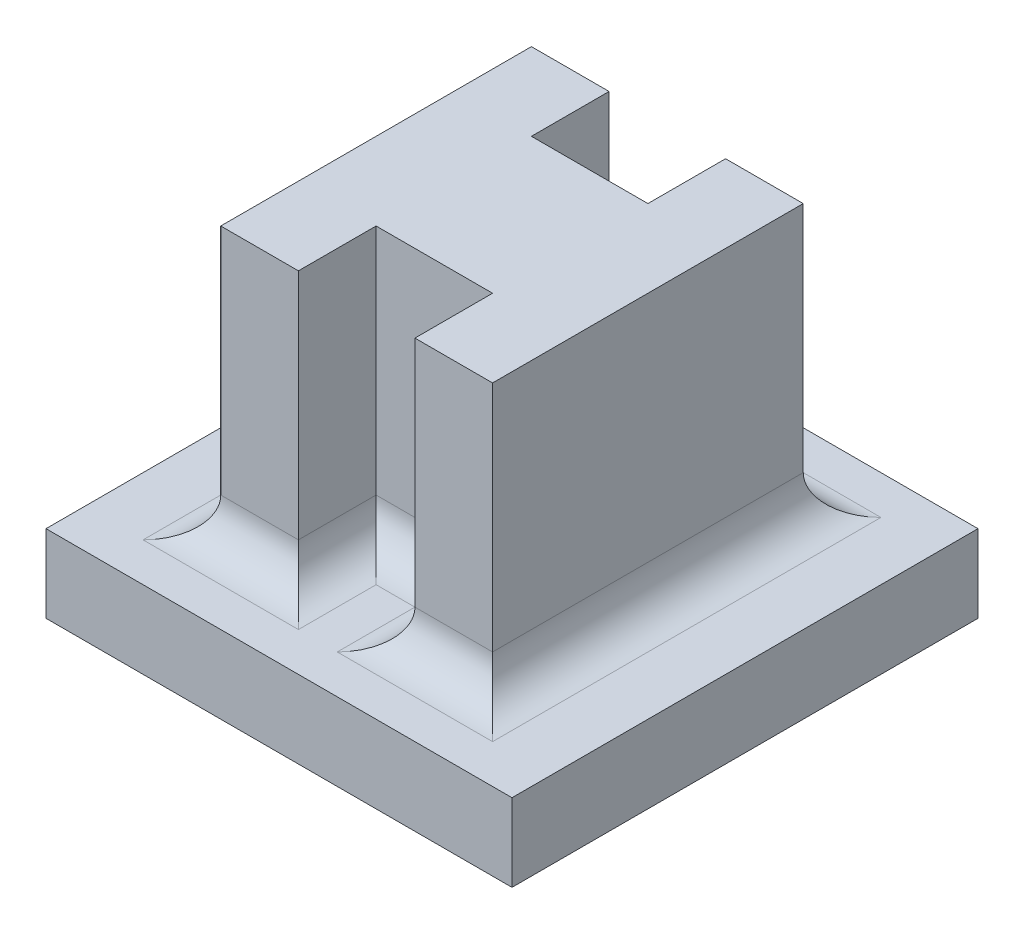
from build123d import *

# Parameters (mm, degrees)
SKETCH1_W      = 60
SKETCH1_H      = 60
EXTRUDE1_DEPTH = 10
EXTRUDE2_DEPTH = 35
FILLET1_R      = 5


with BuildPart() as part:
    # Sketch1 → Extrude1 (new body)
    with BuildSketch(Plane(origin=(0, 0, 0), x_dir=(1, 0, 0), z_dir=(0, 1, 0))):
        Rectangle(SKETCH1_W, SKETCH1_H)
    extrude(amount=EXTRUDE1_DEPTH)

    # Sketch2 → Extrude2 (add)
    with BuildSketch(Plane(origin=(0, 10, 0), x_dir=(-1, 0, 0), z_dir=(0, 1, 0))):
        Polygon((17.5, 20), (17.5, -20), (7.5, -20), (7.5, -10), (-7.5, -10), (-7.5, -20), (-17.5, -20), (-17.5, 20), (-7.5, 20), (-7.5, 10), (7.5, 10), (7.5, 20), align=None)
    extrude(amount=EXTRUDE2_DEPTH)

    # Fillet1
    fillet1_edges = [part.edges().sort_by_distance(p)[0] for p in [
        (-7.5, 10, 15),
        (0, 10, 10),
        (7.5, 10, 15),
        (12.5, 10, 20),
        (17.5, 10, 0),
        (12.5, 10, -20),
        (7.5, 10, -15),
        (0, 10, -10),
        (-7.5, 10, -15),
        (-12.5, 10, -20),
        (-17.5, 10, 0),
        (-12.5, 10, 20),
    ]]
    fillet(fillet1_edges, radius=FILLET1_R)


solid = part.part
